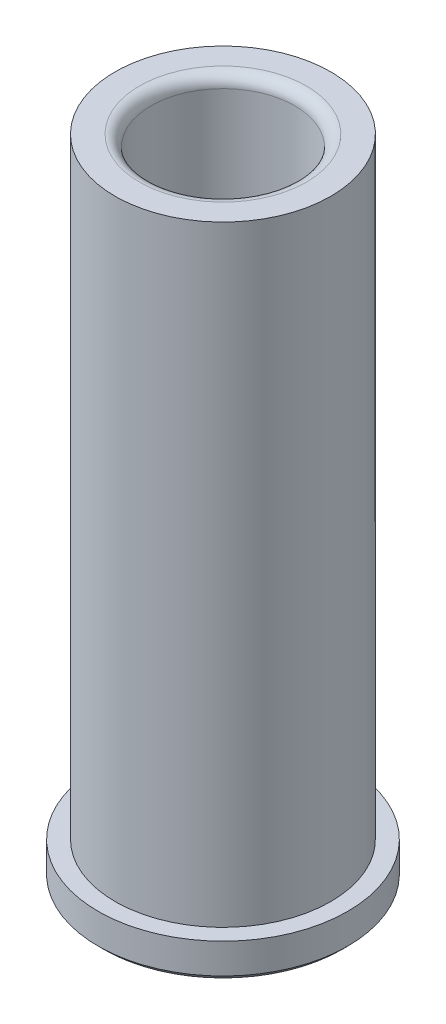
from build123d import *

# Parameters (mm, degrees)
FILLET1_R = 1.524


with BuildPart() as part:
    # Sketch1 → Revolve1 (revolve)
    with BuildSketch(Plane.XY, mode=Mode.PRIVATE) as revolve1_sk:
        Polygon((-15.7734, 0), (-16.5354, 0.762), (-16.5354, 4.7625), (-14.29385, 4.7625), (-14.29385, 85.725), (-9.53135, 85.725), (-9.53135, 0.762), (-10.29335, 0), align=None)
    revolve(revolve1_sk.sketch.rotate(Axis((0, -1000, 0), (0, 1, 0)), 180), axis=Axis((0, -1000, 0), (0, 1, 0)))

    # Fillet1
    fillet1_edges = [part.edges().sort_by_distance(p)[0] for p in [
        (-9.53135, 85.725, 0),
    ]]
    fillet(fillet1_edges, radius=FILLET1_R)


solid = part.part
